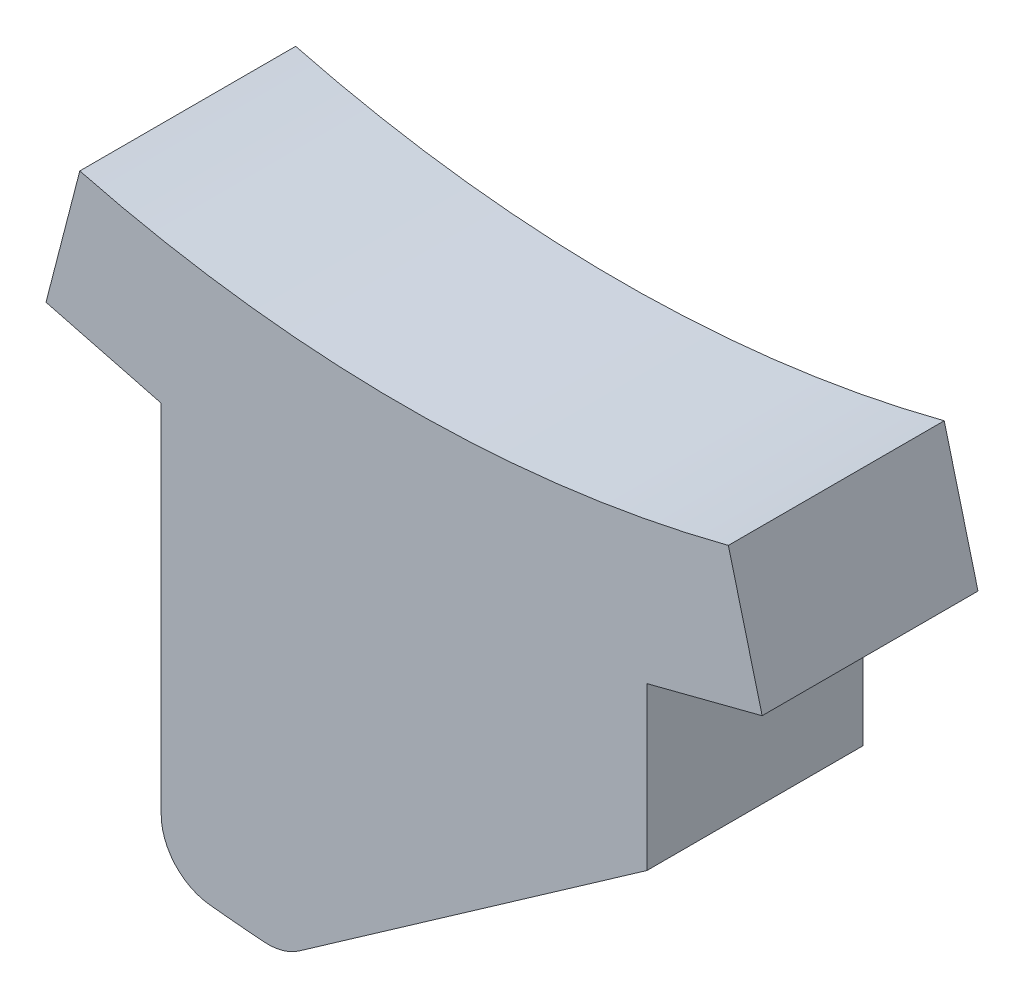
from build123d import *

# Parameters (mm, degrees)
BASE_EXTRUDE_DEPTH = 12.7
FILLET1_R          = 6.35


with BuildPart() as part:
    # Sketch1 → Base-Extrude (new, symmetric)
    with BuildSketch(Plane.XY):
        with BuildLine():
            Line((-38.157912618, 4.854299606), (-42.132695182, -10.515044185))
            Line((-42.132695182, -10.515044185), (-28.575, -14.021302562))
            Line((-28.575, -14.021302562), (-28.575, -61.600652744))
            ThreePointArc((-28.575, -61.600652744), (-21.405882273, -62.436212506), (-14.212841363, -63.031671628))
            Line((-14.212841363, -63.031671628), (28.575, -33.071302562))
            Line((28.575, -33.071302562), (28.575, -14.021302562))
            Line((28.575, -14.021302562), (42.132695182, -10.515044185))
            Line((42.132695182, -10.515044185), (38.157912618, 4.854299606))
            ThreePointArc((38.157912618, 4.854299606), (0, 0), (-38.157912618, 4.854299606))
        make_face()
    extrude(amount=BASE_EXTRUDE_DEPTH, both=True)

    # Fillet1
    fillet1_edges = [part.edges().sort_by_distance(p)[0] for p in [
        (-14.212841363, -63.031671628, 0),
        (-28.575, -61.600652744, 0),
    ]]
    fillet(fillet1_edges, radius=FILLET1_R)


solid = part.part
